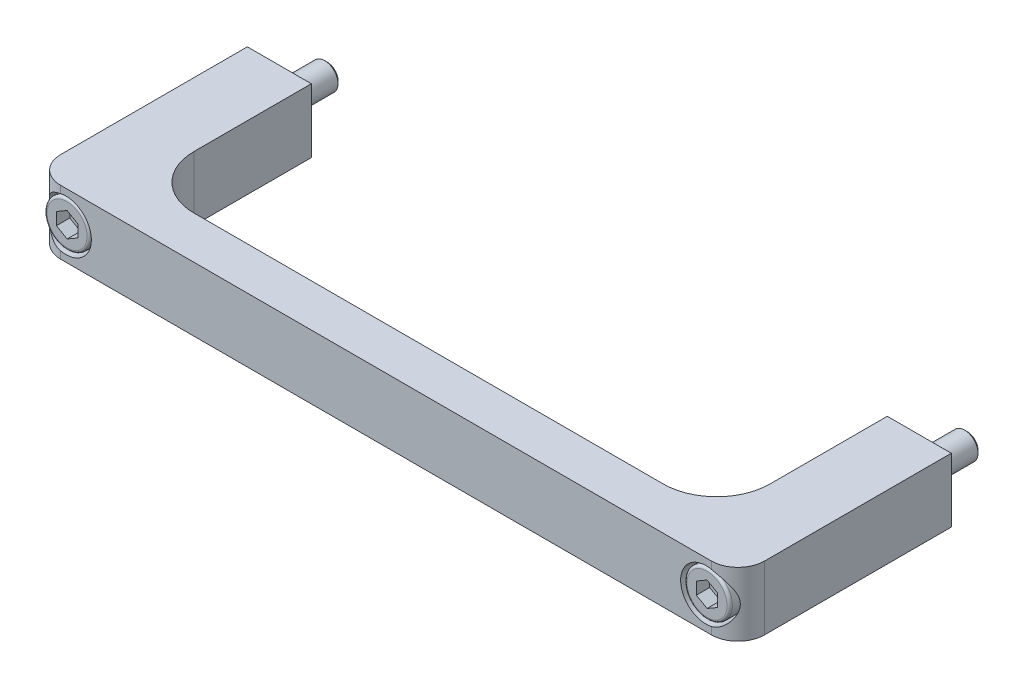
ISO-10303-21;
HEADER;
FILE_DESCRIPTION(('STEP AP214'),'2;1');
FILE_NAME('part.step','',(''),(''),'','','');
FILE_SCHEMA(('AUTOMOTIVE_DESIGN { 1 0 10303 214 1 1 1 1 }'));
ENDSEC;
DATA;
#1=APPLICATION_CONTEXT('core data for automotive mechanical design processes');
#2=APPLICATION_PROTOCOL_DEFINITION('international standard','automotive_design',2000,#1);
#3=PRODUCT_CONTEXT('',#1,'mechanical');
#4=PRODUCT('Part','Part','',(#3));
#5=PRODUCT_RELATED_PRODUCT_CATEGORY('part','',(#4));
#6=PRODUCT_DEFINITION_FORMATION('','',#4);
#7=PRODUCT_DEFINITION_CONTEXT('part definition',#1,'design');
#8=PRODUCT_DEFINITION('design','',#6,#7);
#9=PRODUCT_DEFINITION_SHAPE('','',#8);
#10=(LENGTH_UNIT() NAMED_UNIT(*) SI_UNIT(.MILLI.,.METRE.));
#11=(NAMED_UNIT(*) PLANE_ANGLE_UNIT() SI_UNIT($,.RADIAN.));
#12=(NAMED_UNIT(*) SI_UNIT($,.STERADIAN.) SOLID_ANGLE_UNIT());
#13=UNCERTAINTY_MEASURE_WITH_UNIT(LENGTH_MEASURE(1.E-05),#10,'distance_accuracy_value','');
#14=(GEOMETRIC_REPRESENTATION_CONTEXT(3) GLOBAL_UNCERTAINTY_ASSIGNED_CONTEXT((#13)) GLOBAL_UNIT_ASSIGNED_CONTEXT((#10,
#11,#12)) REPRESENTATION_CONTEXT('',''));
#15=CARTESIAN_POINT('',(0.,0.,0.));
#16=DIRECTION('',(0.,0.,1.));
#17=DIRECTION('',(1.,0.,0.));
#18=AXIS2_PLACEMENT_3D('',#15,#16,#17);
#19=CARTESIAN_POINT('',(120.,-1.38960957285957E-13,39.8));
#20=DIRECTION('',(0.,0.,-1.));
#21=DIRECTION('',(0.,1.,0.));
#22=AXIS2_PLACEMENT_3D('',#19,#20,#21);
#23=PLANE('',#22);
#24=CARTESIAN_POINT('',(120.,-1.38960957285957E-13,39.8));
#25=DIRECTION('',(0.,0.,-1.));
#26=DIRECTION('',(0.,1.,0.));
#27=AXIS2_PLACEMENT_3D('',#24,#25,#26);
#28=CIRCLE('',#27,3.75);
#29=CARTESIAN_POINT('',(120.,3.74999999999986,39.8));
#30=VERTEX_POINT('',#29);
#31=EDGE_CURVE('E268',#30,#30,#28,.T.);
#32=ORIENTED_EDGE('',*,*,#31,.F.);
#33=EDGE_LOOP('',(#32));
#34=FACE_BOUND('',#33,.T.);
#35=DIRECTION('',(0.,-1.,0.));
#36=VECTOR('',#35,1.);
#37=CARTESIAN_POINT('',(118.,-1.38960957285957E-13,39.8));
#38=LINE('',#37,#36);
#39=CARTESIAN_POINT('',(118.,1.15470053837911,39.8));
#40=VERTEX_POINT('',#39);
#41=CARTESIAN_POINT('',(118.,-1.15470053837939,39.8));
#42=VERTEX_POINT('',#41);
#43=EDGE_CURVE('E9',#40,#42,#38,.T.);
#44=ORIENTED_EDGE('',*,*,#43,.F.);
#45=DIRECTION('',(-0.866025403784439,-0.5,0.));
#46=VECTOR('',#45,1.);
#47=CARTESIAN_POINT('',(119.,1.73205080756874,39.8));
#48=LINE('',#47,#46);
#49=CARTESIAN_POINT('',(120.,2.30940107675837,39.8));
#50=VERTEX_POINT('',#49);
#51=EDGE_CURVE('E433',#50,#40,#48,.T.);
#52=ORIENTED_EDGE('',*,*,#51,.F.);
#53=DIRECTION('',(-0.866025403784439,0.5,0.));
#54=VECTOR('',#53,1.);
#55=CARTESIAN_POINT('',(121.,1.73205080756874,39.8));
#56=LINE('',#55,#54);
#57=CARTESIAN_POINT('',(122.,1.15470053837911,39.8));
#58=VERTEX_POINT('',#57);
#59=EDGE_CURVE('E435',#58,#50,#56,.T.);
#60=ORIENTED_EDGE('',*,*,#59,.F.);
#61=DIRECTION('',(0.,1.,0.));
#62=VECTOR('',#61,1.);
#63=CARTESIAN_POINT('',(122.,-1.38960957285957E-13,39.8));
#64=LINE('',#63,#62);
#65=CARTESIAN_POINT('',(122.,-1.15470053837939,39.8));
#66=VERTEX_POINT('',#65);
#67=EDGE_CURVE('E437',#66,#58,#64,.T.);
#68=ORIENTED_EDGE('',*,*,#67,.F.);
#69=DIRECTION('',(0.866025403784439,0.5,0.));
#70=VECTOR('',#69,1.);
#71=CARTESIAN_POINT('',(121.,-1.73205080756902,39.8));
#72=LINE('',#71,#70);
#73=CARTESIAN_POINT('',(120.,-2.30940107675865,39.8));
#74=VERTEX_POINT('',#73);
#75=EDGE_CURVE('E439',#74,#66,#72,.T.);
#76=ORIENTED_EDGE('',*,*,#75,.F.);
#77=DIRECTION('',(0.866025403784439,-0.5,0.));
#78=VECTOR('',#77,1.);
#79=CARTESIAN_POINT('',(119.,-1.73205080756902,39.8));
#80=LINE('',#79,#78);
#81=EDGE_CURVE('E23',#42,#74,#80,.T.);
#82=ORIENTED_EDGE('',*,*,#81,.F.);
#83=EDGE_LOOP('',(#44,#52,#60,#68,#76,#82));
#84=FACE_BOUND('',#83,.T.);
#85=ADVANCED_FACE('F14',(#34,#84),#23,.F.);
#86=CARTESIAN_POINT('',(0.,-1.38960957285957E-13,39.8));
#87=DIRECTION('',(0.,0.,-1.));
#88=DIRECTION('',(0.,1.,0.));
#89=AXIS2_PLACEMENT_3D('',#86,#87,#88);
#90=PLANE('',#89);
#91=CARTESIAN_POINT('',(0.,-1.38960957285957E-13,39.8));
#92=DIRECTION('',(0.,0.,-1.));
#93=DIRECTION('',(0.,1.,0.));
#94=AXIS2_PLACEMENT_3D('',#91,#92,#93);
#95=CIRCLE('',#94,3.75);
#96=CARTESIAN_POINT('',(0.,3.74999999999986,39.8));
#97=VERTEX_POINT('',#96);
#98=EDGE_CURVE('E277',#97,#97,#95,.T.);
#99=ORIENTED_EDGE('',*,*,#98,.F.);
#100=EDGE_LOOP('',(#99));
#101=FACE_BOUND('',#100,.T.);
#102=DIRECTION('',(0.,-1.,0.));
#103=VECTOR('',#102,1.);
#104=CARTESIAN_POINT('',(-2.,-1.38960957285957E-13,39.8));
#105=LINE('',#104,#103);
#106=CARTESIAN_POINT('',(-2.,1.15470053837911,39.8));
#107=VERTEX_POINT('',#106);
#108=CARTESIAN_POINT('',(-2.,-1.15470053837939,39.8));
#109=VERTEX_POINT('',#108);
#110=EDGE_CURVE('E431',#107,#109,#105,.T.);
#111=ORIENTED_EDGE('',*,*,#110,.F.);
#112=DIRECTION('',(-0.866025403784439,-0.5,0.));
#113=VECTOR('',#112,1.);
#114=CARTESIAN_POINT('',(-1.,1.73205080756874,39.8));
#115=LINE('',#114,#113);
#116=CARTESIAN_POINT('',(0.,2.30940107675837,39.8));
#117=VERTEX_POINT('',#116);
#118=EDGE_CURVE('E420',#117,#107,#115,.T.);
#119=ORIENTED_EDGE('',*,*,#118,.F.);
#120=DIRECTION('',(-0.866025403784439,0.5,0.));
#121=VECTOR('',#120,1.);
#122=CARTESIAN_POINT('',(1.,1.73205080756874,39.8));
#123=LINE('',#122,#121);
#124=CARTESIAN_POINT('',(2.,1.15470053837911,39.8));
#125=VERTEX_POINT('',#124);
#126=EDGE_CURVE('E422',#125,#117,#123,.T.);
#127=ORIENTED_EDGE('',*,*,#126,.F.);
#128=DIRECTION('',(0.,1.,0.));
#129=VECTOR('',#128,1.);
#130=CARTESIAN_POINT('',(2.,-1.38960957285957E-13,39.8));
#131=LINE('',#130,#129);
#132=CARTESIAN_POINT('',(2.,-1.15470053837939,39.8));
#133=VERTEX_POINT('',#132);
#134=EDGE_CURVE('E424',#133,#125,#131,.T.);
#135=ORIENTED_EDGE('',*,*,#134,.F.);
#136=DIRECTION('',(0.866025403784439,0.5,0.));
#137=VECTOR('',#136,1.);
#138=CARTESIAN_POINT('',(1.,-1.73205080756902,39.8));
#139=LINE('',#138,#137);
#140=CARTESIAN_POINT('',(0.,-2.30940107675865,39.8));
#141=VERTEX_POINT('',#140);
#142=EDGE_CURVE('E426',#141,#133,#139,.T.);
#143=ORIENTED_EDGE('',*,*,#142,.F.);
#144=DIRECTION('',(0.866025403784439,-0.5,0.));
#145=VECTOR('',#144,1.);
#146=CARTESIAN_POINT('',(-1.,-1.73205080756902,39.8));
#147=LINE('',#146,#145);
#148=EDGE_CURVE('E429',#109,#141,#147,.T.);
#149=ORIENTED_EDGE('',*,*,#148,.F.);
#150=EDGE_LOOP('',(#111,#119,#127,#135,#143,#149));
#151=FACE_BOUND('',#150,.T.);
#152=ADVANCED_FACE('F520',(#101,#151),#90,.F.);
#153=CARTESIAN_POINT('',(121.,-6.00000000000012,35.));
#154=DIRECTION('',(0.,1.,0.));
#155=DIRECTION('',(-1.,0.,0.));
#156=AXIS2_PLACEMENT_3D('',#153,#154,#155);
#157=CYLINDRICAL_SURFACE('',#156,5.);
#158=CARTESIAN_POINT('',(121.,-4.64354390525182,40.));
#159=CARTESIAN_POINT('',(121.113577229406,-4.61911352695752,40.000026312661));
#160=CARTESIAN_POINT('',(121.226198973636,-4.5904727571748,39.996131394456));
#161=CARTESIAN_POINT('',(121.448480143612,-4.5252330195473,39.9810830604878));
#162=CARTESIAN_POINT('',(121.558142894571,-4.48864344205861,39.9699381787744));
#163=CARTESIAN_POINT('',(121.772778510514,-4.40826406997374,39.9410985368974));
#164=CARTESIAN_POINT('',(121.877784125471,-4.36454038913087,39.9234622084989));
#165=CARTESIAN_POINT('',(122.083450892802,-4.2701927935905,39.8823298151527));
#166=CARTESIAN_POINT('',(122.184110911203,-4.2195670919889,39.8588322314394));
#167=CARTESIAN_POINT('',(122.477816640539,-4.05863601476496,39.7808868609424));
#168=CARTESIAN_POINT('',(122.663755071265,-3.93883272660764,39.7188155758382));
#169=CARTESIAN_POINT('',(123.014161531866,-3.67767986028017,39.5802666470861));
#170=CARTESIAN_POINT('',(123.178576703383,-3.53627901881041,39.5037546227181));
#171=CARTESIAN_POINT('',(123.50556315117,-3.21450833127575,39.3313669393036));
#172=CARTESIAN_POINT('',(123.664844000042,-3.03145406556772,39.2342729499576));
#173=CARTESIAN_POINT('',(123.953554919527,-2.64393120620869,39.0381869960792));
#174=CARTESIAN_POINT('',(124.082967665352,-2.43945028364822,38.9391939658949));
#175=CARTESIAN_POINT('',(124.300406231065,-2.02927596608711,38.7583847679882));
#176=CARTESIAN_POINT('',(124.391102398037,-1.82533494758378,38.6758243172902));
#177=CARTESIAN_POINT('',(124.544220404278,-1.40111936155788,38.528431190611));
#178=CARTESIAN_POINT('',(124.606705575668,-1.1808826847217,38.4635589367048));
#179=CARTESIAN_POINT('',(124.68939020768,-0.77750572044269,38.3750946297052));
#180=CARTESIAN_POINT('',(124.715905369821,-0.597016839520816,38.3455288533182));
#181=CARTESIAN_POINT('',(124.74785251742,-0.232010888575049,38.3097185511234));
#182=CARTESIAN_POINT('',(124.753317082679,-0.047500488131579,38.3034379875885));
#183=CARTESIAN_POINT('',(124.742772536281,0.320047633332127,38.3153716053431));
#184=CARTESIAN_POINT('',(124.726764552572,0.503085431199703,38.3335844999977));
#185=CARTESIAN_POINT('',(124.674507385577,0.862962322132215,38.3910845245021));
#186=CARTESIAN_POINT('',(124.638217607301,1.03978822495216,38.4304139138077));
#187=CARTESIAN_POINT('',(124.5280009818,1.4574449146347,38.5442545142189));
#188=CARTESIAN_POINT('',(124.444640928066,1.69363572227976,38.626612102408));
#189=CARTESIAN_POINT('',(124.295087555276,2.03224760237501,38.7612447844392));
#190=CARTESIAN_POINT('',(124.24105214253,2.1426583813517,38.8080496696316));
#191=CARTESIAN_POINT('',(124.12505065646,2.35826640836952,38.9038071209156));
#192=CARTESIAN_POINT('',(124.063085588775,2.46346431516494,38.9527594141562));
#193=CARTESIAN_POINT('',(123.860708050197,2.77873907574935,39.1043117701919));
#194=CARTESIAN_POINT('',(123.707477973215,2.98020199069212,39.2081022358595));
#195=CARTESIAN_POINT('',(123.368846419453,3.35822314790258,39.4076351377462));
#196=CARTESIAN_POINT('',(123.183479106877,3.53480748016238,39.5033859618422));
#197=CARTESIAN_POINT('',(122.809666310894,3.83632408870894,39.6648073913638));
#198=CARTESIAN_POINT('',(122.625331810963,3.96502834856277,39.7328152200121));
#199=CARTESIAN_POINT('',(122.333406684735,4.13890556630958,39.8199942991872));
#200=CARTESIAN_POINT('',(122.233611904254,4.19363274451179,39.8465668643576));
#201=CARTESIAN_POINT('',(122.029283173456,4.29622741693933,39.8940340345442));
#202=CARTESIAN_POINT('',(121.924750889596,4.34409729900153,39.9149306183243));
#203=CARTESIAN_POINT('',(121.687151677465,4.4425312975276,39.9543331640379));
#204=CARTESIAN_POINT('',(121.55301541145,4.49121867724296,39.9712061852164));
#205=CARTESIAN_POINT('',(121.348187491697,4.55522115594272,39.9883353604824));
#206=CARTESIAN_POINT('',(121.279206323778,4.57507245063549,39.9926820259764));
#207=CARTESIAN_POINT('',(121.140272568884,4.61166374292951,39.9985159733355));
#208=CARTESIAN_POINT('',(121.070319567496,4.62840236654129,40.0000019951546));
#209=CARTESIAN_POINT('',(121.,4.64354390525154,40.));
#210=B_SPLINE_CURVE_WITH_KNOTS('',3,(#158,#159,#160,#161,#162,#163,#164,#165,#166,#167,#168,
#169,#170,#171,#172,#173,#174,#175,#176,#177,#178,#179,#180,#181,#182,#183,#184,#185,#186,#187,
#188,#189,#190,#191,#192,#193,#194,#195,#196,#197,#198,#199,#200,#201,#202,#203,#204,#205,#206,
#207,#208,#209),.UNSPECIFIED.,.F.,.F.,(4,2,2,2,2,2,2,2,2,2,2,2,2,2,2,2,2,2,2,2,2,2,2,2,2,4),(0.,
0.348307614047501,0.696205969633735,1.04104644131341,1.38597636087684,2.07210353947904,
2.7598853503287,3.54118531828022,4.32293734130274,5.03460033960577,5.74465765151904,
6.29670085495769,6.84788932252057,7.3990488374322,7.95131549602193,8.73767249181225,
9.13202620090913,9.52632994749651,10.3438248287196,11.1604559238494,11.8620649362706,
12.2123213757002,12.5624555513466,12.992467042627,13.2080905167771,13.4238089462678),.UNSPECIFIED.);
#211=CARTESIAN_POINT('',(121.,-4.64354390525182,40.));
#212=VERTEX_POINT('',#211);
#213=CARTESIAN_POINT('',(121.,4.64354390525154,40.));
#214=VERTEX_POINT('',#213);
#215=EDGE_CURVE('E283',#212,#214,#210,.T.);
#216=ORIENTED_EDGE('',*,*,#215,.F.);
#217=DIRECTION('',(0.,1.,0.));
#218=VECTOR('',#217,1.);
#219=CARTESIAN_POINT('',(121.,-6.00000000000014,40.));
#220=LINE('',#219,#218);
#221=CARTESIAN_POINT('',(121.,-6.00000000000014,40.));
#222=VERTEX_POINT('',#221);
#223=EDGE_CURVE('E387',#222,#212,#220,.T.);
#224=ORIENTED_EDGE('',*,*,#223,.F.);
#225=CARTESIAN_POINT('',(121.,-6.00000000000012,35.));
#226=DIRECTION('',(0.,-1.,0.));
#227=DIRECTION('',(1.,0.,0.));
#228=AXIS2_PLACEMENT_3D('',#225,#226,#227);
#229=CIRCLE('',#228,5.);
#230=CARTESIAN_POINT('',(126.,-6.00000000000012,35.));
#231=VERTEX_POINT('',#230);
#232=EDGE_CURVE('E349',#231,#222,#229,.T.);
#233=ORIENTED_EDGE('',*,*,#232,.F.);
#234=DIRECTION('',(0.,1.,0.));
#235=VECTOR('',#234,1.);
#236=CARTESIAN_POINT('',(126.,-6.00000000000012,35.));
#237=LINE('',#236,#235);
#238=CARTESIAN_POINT('',(126.,5.99999999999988,35.));
#239=VERTEX_POINT('',#238);
#240=EDGE_CURVE('E390',#231,#239,#237,.T.);
#241=ORIENTED_EDGE('',*,*,#240,.T.);
#242=CARTESIAN_POINT('',(121.,5.99999999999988,35.));
#243=DIRECTION('',(0.,-1.,0.));
#244=DIRECTION('',(1.,0.,0.));
#245=AXIS2_PLACEMENT_3D('',#242,#243,#244);
#246=CIRCLE('',#245,5.);
#247=CARTESIAN_POINT('',(121.,5.99999999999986,40.));
#248=VERTEX_POINT('',#247);
#249=EDGE_CURVE('E378',#239,#248,#246,.T.);
#250=ORIENTED_EDGE('',*,*,#249,.T.);
#251=EDGE_CURVE('E386',#214,#248,#220,.T.);
#252=ORIENTED_EDGE('',*,*,#251,.F.);
#253=EDGE_LOOP('',(#216,#224,#233,#241,#250,#252));
#254=FACE_BOUND('',#253,.T.);
#255=ADVANCED_FACE('F293',(#254),#157,.T.);
#256=CARTESIAN_POINT('',(-1.,-6.00000000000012,35.));
#257=DIRECTION('',(0.,1.,0.));
#258=DIRECTION('',(-1.,0.,0.));
#259=AXIS2_PLACEMENT_3D('',#256,#257,#258);
#260=CYLINDRICAL_SURFACE('',#259,5.);
#261=CARTESIAN_POINT('',(-0.999999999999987,4.64354390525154,40.));
#262=CARTESIAN_POINT('',(-1.11357722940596,4.61911352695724,40.000026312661));
#263=CARTESIAN_POINT('',(-1.22619897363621,4.59047275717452,39.9961313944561));
#264=CARTESIAN_POINT('',(-1.44848014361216,4.52523301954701,39.9810830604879));
#265=CARTESIAN_POINT('',(-1.55814289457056,4.48864344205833,39.9699381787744));
#266=CARTESIAN_POINT('',(-1.7727785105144,4.40826406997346,39.9410985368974));
#267=CARTESIAN_POINT('',(-1.87778412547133,4.3645403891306,39.9234622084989));
#268=CARTESIAN_POINT('',(-2.08345089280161,4.27019279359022,39.8823298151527));
#269=CARTESIAN_POINT('',(-2.18411091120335,4.21956709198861,39.8588322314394));
#270=CARTESIAN_POINT('',(-2.47781664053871,4.05863601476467,39.7808868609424));
#271=CARTESIAN_POINT('',(-2.66375507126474,3.93883272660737,39.7188155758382));
#272=CARTESIAN_POINT('',(-3.0141615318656,3.67767986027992,39.5802666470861));
#273=CARTESIAN_POINT('',(-3.17857670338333,3.53627901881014,39.5037546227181));
#274=CARTESIAN_POINT('',(-3.50556315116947,3.21450833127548,39.3313669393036));
#275=CARTESIAN_POINT('',(-3.66484400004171,3.03145406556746,39.2342729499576));
#276=CARTESIAN_POINT('',(-3.95355491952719,2.64393120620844,39.0381869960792));
#277=CARTESIAN_POINT('',(-4.0829676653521,2.43945028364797,38.9391939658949));
#278=CARTESIAN_POINT('',(-4.30040623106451,2.02927596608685,38.7583847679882));
#279=CARTESIAN_POINT('',(-4.39110239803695,1.82533494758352,38.6758243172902));
#280=CARTESIAN_POINT('',(-4.54422040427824,1.40111936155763,38.528431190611));
#281=CARTESIAN_POINT('',(-4.606705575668,1.18088268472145,38.4635589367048));
#282=CARTESIAN_POINT('',(-4.68939020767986,0.777505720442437,38.3750946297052));
#283=CARTESIAN_POINT('',(-4.71590536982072,0.597016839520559,38.3455288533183));
#284=CARTESIAN_POINT('',(-4.74785251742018,0.23201088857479,38.3097185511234));
#285=CARTESIAN_POINT('',(-4.75331708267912,0.0475004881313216,38.3034379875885));
#286=CARTESIAN_POINT('',(-4.74277253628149,-0.320047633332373,38.3153716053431));
#287=CARTESIAN_POINT('',(-4.72676455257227,-0.503085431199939,38.3335844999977));
#288=CARTESIAN_POINT('',(-4.67450738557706,-0.862962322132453,38.3910845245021));
#289=CARTESIAN_POINT('',(-4.63821760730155,-1.03978822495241,38.4304139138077));
#290=CARTESIAN_POINT('',(-4.52800098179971,-1.45744491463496,38.5442545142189));
#291=CARTESIAN_POINT('',(-4.44464092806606,-1.69363572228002,38.626612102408));
#292=CARTESIAN_POINT('',(-4.29508755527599,-2.03224760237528,38.7612447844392));
#293=CARTESIAN_POINT('',(-4.24105214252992,-2.14265838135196,38.8080496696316));
#294=CARTESIAN_POINT('',(-4.1250506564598,-2.35826640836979,38.9038071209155));
#295=CARTESIAN_POINT('',(-4.06308558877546,-2.4634643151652,38.9527594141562));
#296=CARTESIAN_POINT('',(-3.86070805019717,-2.7787390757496,39.1043117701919));
#297=CARTESIAN_POINT('',(-3.70747797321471,-2.98020199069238,39.2081022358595));
#298=CARTESIAN_POINT('',(-3.36884641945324,-3.35822314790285,39.4076351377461));
#299=CARTESIAN_POINT('',(-3.18347910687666,-3.53480748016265,39.5033859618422));
#300=CARTESIAN_POINT('',(-2.80966631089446,-3.83632408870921,39.6648073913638));
#301=CARTESIAN_POINT('',(-2.62533181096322,-3.96502834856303,39.7328152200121));
#302=CARTESIAN_POINT('',(-2.33340668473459,-4.13890556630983,39.8199942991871));
#303=CARTESIAN_POINT('',(-2.23361190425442,-4.19363274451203,39.8465668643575));
#304=CARTESIAN_POINT('',(-2.0292831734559,-4.29622741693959,39.8940340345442));
#305=CARTESIAN_POINT('',(-1.92475088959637,-4.34409729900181,39.9149306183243));
#306=CARTESIAN_POINT('',(-1.68715167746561,-4.44253129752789,39.9543331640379));
#307=CARTESIAN_POINT('',(-1.55301541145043,-4.49121867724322,39.9712061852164));
#308=CARTESIAN_POINT('',(-1.34818749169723,-4.55522115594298,39.9883353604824));
#309=CARTESIAN_POINT('',(-1.27920632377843,-4.57507245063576,39.9926820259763));
#310=CARTESIAN_POINT('',(-1.14027256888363,-4.61166374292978,39.9985159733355));
#311=CARTESIAN_POINT('',(-1.07031956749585,-4.62840236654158,40.0000019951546));
#312=CARTESIAN_POINT('',(-0.999999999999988,-4.64354390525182,40.));
#313=B_SPLINE_CURVE_WITH_KNOTS('',3,(#261,#262,#263,#264,#265,#266,#267,#268,#269,#270,#271,
#272,#273,#274,#275,#276,#277,#278,#279,#280,#281,#282,#283,#284,#285,#286,#287,#288,#289,#290,
#291,#292,#293,#294,#295,#296,#297,#298,#299,#300,#301,#302,#303,#304,#305,#306,#307,#308,#309,
#310,#311,#312),.UNSPECIFIED.,.F.,.F.,(4,2,2,2,2,2,2,2,2,2,2,2,2,2,2,2,2,2,2,2,2,2,2,2,2,4),(0.,
0.348307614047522,0.696205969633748,1.04104644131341,1.38597636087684,2.07210353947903,
2.75988535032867,3.54118531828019,4.32293734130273,5.03460033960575,5.74465765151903,
6.29670085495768,6.84788932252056,7.39904883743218,7.95131549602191,8.73767249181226,
9.13202620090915,9.52632994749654,10.3438248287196,11.1604559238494,11.8620649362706,
12.2123213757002,12.5624555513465,12.992467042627,13.2080905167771,13.4238089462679),.UNSPECIFIED.);
#314=CARTESIAN_POINT('',(-0.999999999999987,4.64354390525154,40.));
#315=VERTEX_POINT('',#314);
#316=CARTESIAN_POINT('',(-0.999999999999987,-4.64354390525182,40.));
#317=VERTEX_POINT('',#316);
#318=EDGE_CURVE('E317',#315,#317,#313,.T.);
#319=ORIENTED_EDGE('',*,*,#318,.F.);
#320=DIRECTION('',(0.,1.,0.));
#321=VECTOR('',#320,1.);
#322=CARTESIAN_POINT('',(-0.999999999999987,-6.00000000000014,40.));
#323=LINE('',#322,#321);
#324=CARTESIAN_POINT('',(-0.999999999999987,5.99999999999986,40.));
#325=VERTEX_POINT('',#324);
#326=EDGE_CURVE('E353',#315,#325,#323,.T.);
#327=ORIENTED_EDGE('',*,*,#326,.T.);
#328=CARTESIAN_POINT('',(-1.,5.99999999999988,35.));
#329=DIRECTION('',(0.,-1.,0.));
#330=DIRECTION('',(1.,0.,0.));
#331=AXIS2_PLACEMENT_3D('',#328,#329,#330);
#332=CIRCLE('',#331,5.);
#333=CARTESIAN_POINT('',(-6.,5.99999999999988,35.));
#334=VERTEX_POINT('',#333);
#335=EDGE_CURVE('E324',#325,#334,#332,.T.);
#336=ORIENTED_EDGE('',*,*,#335,.T.);
#337=DIRECTION('',(0.,1.,0.));
#338=VECTOR('',#337,1.);
#339=CARTESIAN_POINT('',(-6.,-6.00000000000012,35.));
#340=LINE('',#339,#338);
#341=CARTESIAN_POINT('',(-6.,-6.00000000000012,35.));
#342=VERTEX_POINT('',#341);
#343=EDGE_CURVE('E413',#342,#334,#340,.T.);
#344=ORIENTED_EDGE('',*,*,#343,.F.);
#345=CARTESIAN_POINT('',(-1.,-6.00000000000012,35.));
#346=DIRECTION('',(0.,-1.,0.));
#347=DIRECTION('',(1.,0.,0.));
#348=AXIS2_PLACEMENT_3D('',#345,#346,#347);
#349=CIRCLE('',#348,5.);
#350=CARTESIAN_POINT('',(-0.999999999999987,-6.00000000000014,40.));
#351=VERTEX_POINT('',#350);
#352=EDGE_CURVE('E325',#351,#342,#349,.T.);
#353=ORIENTED_EDGE('',*,*,#352,.F.);
#354=EDGE_CURVE('E383',#351,#317,#323,.T.);
#355=ORIENTED_EDGE('',*,*,#354,.T.);
#356=EDGE_LOOP('',(#319,#327,#336,#344,#353,#355));
#357=FACE_BOUND('',#356,.T.);
#358=ADVANCED_FACE('F16',(#357),#260,.T.);
#359=CARTESIAN_POINT('',(-6.,-6.00000000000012,35.));
#360=DIRECTION('',(1.,0.,0.));
#361=DIRECTION('',(0.,1.,0.));
#362=AXIS2_PLACEMENT_3D('',#359,#360,#361);
#363=PLANE('',#362);
#364=DIRECTION('',(0.,0.,-1.));
#365=VECTOR('',#364,1.);
#366=CARTESIAN_POINT('',(-6.,5.99999999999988,35.));
#367=LINE('',#366,#365);
#368=CARTESIAN_POINT('',(-6.,6.,0.));
#369=VERTEX_POINT('',#368);
#370=EDGE_CURVE('E356',#334,#369,#367,.T.);
#371=ORIENTED_EDGE('',*,*,#370,.T.);
#372=DIRECTION('',(0.,1.,0.));
#373=VECTOR('',#372,1.);
#374=CARTESIAN_POINT('',(-6.,-6.,0.));
#375=LINE('',#374,#373);
#376=CARTESIAN_POINT('',(-6.,-6.,0.));
#377=VERTEX_POINT('',#376);
#378=EDGE_CURVE('E410',#377,#369,#375,.T.);
#379=ORIENTED_EDGE('',*,*,#378,.F.);
#380=DIRECTION('',(0.,0.,-1.));
#381=VECTOR('',#380,1.);
#382=CARTESIAN_POINT('',(-6.,-6.00000000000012,35.));
#383=LINE('',#382,#381);
#384=EDGE_CURVE('E328',#342,#377,#383,.T.);
#385=ORIENTED_EDGE('',*,*,#384,.F.);
#386=ORIENTED_EDGE('',*,*,#343,.T.);
#387=EDGE_LOOP('',(#371,#379,#385,#386));
#388=FACE_BOUND('',#387,.T.);
#389=ADVANCED_FACE('F565',(#388),#363,.F.);
#390=CARTESIAN_POINT('',(-6.,-6.,0.));
#391=DIRECTION('',(0.,0.,1.));
#392=DIRECTION('',(0.,-1.,0.));
#393=AXIS2_PLACEMENT_3D('',#390,#391,#392);
#394=PLANE('',#393);
#395=DIRECTION('',(1.,0.,0.));
#396=VECTOR('',#395,1.);
#397=CARTESIAN_POINT('',(-6.,6.,0.));
#398=LINE('',#397,#396);
#399=CARTESIAN_POINT('',(6.,6.,0.));
#400=VERTEX_POINT('',#399);
#401=EDGE_CURVE('E358',#369,#400,#398,.T.);
#402=ORIENTED_EDGE('',*,*,#401,.T.);
#403=DIRECTION('',(0.,1.,0.));
#404=VECTOR('',#403,1.);
#405=CARTESIAN_POINT('',(6.,-6.,0.));
#406=LINE('',#405,#404);
#407=CARTESIAN_POINT('',(6.,-6.,0.));
#408=VERTEX_POINT('',#407);
#409=EDGE_CURVE('E407',#408,#400,#406,.T.);
#410=ORIENTED_EDGE('',*,*,#409,.F.);
#411=DIRECTION('',(1.,0.,0.));
#412=VECTOR('',#411,1.);
#413=CARTESIAN_POINT('',(-6.,-6.,0.));
#414=LINE('',#413,#412);
#415=EDGE_CURVE('E331',#377,#408,#414,.T.);
#416=ORIENTED_EDGE('',*,*,#415,.F.);
#417=ORIENTED_EDGE('',*,*,#378,.T.);
#418=EDGE_LOOP('',(#402,#410,#416,#417));
#419=FACE_BOUND('',#418,.T.);
#420=CARTESIAN_POINT('',(0.,0.,0.));
#421=DIRECTION('',(0.,0.,-1.));
#422=DIRECTION('',(0.,1.,0.));
#423=AXIS2_PLACEMENT_3D('',#420,#421,#422);
#424=CIRCLE('',#423,2.5);
#425=CARTESIAN_POINT('',(0.,2.5,0.));
#426=VERTEX_POINT('',#425);
#427=EDGE_CURVE('E912',#426,#426,#424,.T.);
#428=ORIENTED_EDGE('',*,*,#427,.F.);
#429=EDGE_LOOP('',(#428));
#430=FACE_BOUND('',#429,.T.);
#431=ADVANCED_FACE('F600',(#419,#430),#394,.F.);
#432=CARTESIAN_POINT('',(6.,-6.,0.));
#433=DIRECTION('',(-1.,0.,0.));
#434=DIRECTION('',(0.,-1.,0.));
#435=AXIS2_PLACEMENT_3D('',#432,#433,#434);
#436=PLANE('',#435);
#437=DIRECTION('',(0.,0.,1.));
#438=VECTOR('',#437,1.);
#439=CARTESIAN_POINT('',(6.,6.,0.));
#440=LINE('',#439,#438);
#441=CARTESIAN_POINT('',(6.,5.99999999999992,22.));
#442=VERTEX_POINT('',#441);
#443=EDGE_CURVE('E360',#400,#442,#440,.T.);
#444=ORIENTED_EDGE('',*,*,#443,.T.);
#445=DIRECTION('',(0.,1.,0.));
#446=VECTOR('',#445,1.);
#447=CARTESIAN_POINT('',(6.,-6.00000000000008,22.));
#448=LINE('',#447,#446);
#449=CARTESIAN_POINT('',(6.,-6.00000000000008,22.));
#450=VERTEX_POINT('',#449);
#451=EDGE_CURVE('E405',#450,#442,#448,.T.);
#452=ORIENTED_EDGE('',*,*,#451,.F.);
#453=DIRECTION('',(0.,0.,1.));
#454=VECTOR('',#453,1.);
#455=CARTESIAN_POINT('',(6.,-6.,0.));
#456=LINE('',#455,#454);
#457=EDGE_CURVE('E333',#408,#450,#456,.T.);
#458=ORIENTED_EDGE('',*,*,#457,.F.);
#459=ORIENTED_EDGE('',*,*,#409,.T.);
#460=EDGE_LOOP('',(#444,#452,#458,#459));
#461=FACE_BOUND('',#460,.T.);
#462=ADVANCED_FACE('F605',(#461),#436,.F.);
#463=CARTESIAN_POINT('',(16.,-6.00000000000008,22.));
#464=DIRECTION('',(0.,1.,0.));
#465=DIRECTION('',(-1.,0.,0.));
#466=AXIS2_PLACEMENT_3D('',#463,#464,#465);
#467=CYLINDRICAL_SURFACE('',#466,10.);
#468=CARTESIAN_POINT('',(16.,5.99999999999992,22.));
#469=DIRECTION('',(0.,-1.,0.));
#470=DIRECTION('',(1.,0.,0.));
#471=AXIS2_PLACEMENT_3D('',#468,#469,#470);
#472=CIRCLE('',#471,10.);
#473=CARTESIAN_POINT('',(16.,5.99999999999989,32.));
#474=VERTEX_POINT('',#473);
#475=EDGE_CURVE('E363',#474,#442,#472,.T.);
#476=ORIENTED_EDGE('',*,*,#475,.F.);
#477=DIRECTION('',(0.,1.,0.));
#478=VECTOR('',#477,1.);
#479=CARTESIAN_POINT('',(16.,-6.00000000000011,32.));
#480=LINE('',#479,#478);
#481=CARTESIAN_POINT('',(16.,-6.00000000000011,32.));
#482=VERTEX_POINT('',#481);
#483=EDGE_CURVE('E403',#482,#474,#480,.T.);
#484=ORIENTED_EDGE('',*,*,#483,.F.);
#485=CARTESIAN_POINT('',(16.,-6.00000000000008,22.));
#486=DIRECTION('',(0.,-1.,0.));
#487=DIRECTION('',(1.,0.,0.));
#488=AXIS2_PLACEMENT_3D('',#485,#486,#487);
#489=CIRCLE('',#488,10.);
#490=EDGE_CURVE('E335',#482,#450,#489,.T.);
#491=ORIENTED_EDGE('',*,*,#490,.T.);
#492=ORIENTED_EDGE('',*,*,#451,.T.);
#493=EDGE_LOOP('',(#476,#484,#491,#492));
#494=FACE_BOUND('',#493,.T.);
#495=ADVANCED_FACE('F608',(#494),#467,.F.);
#496=CARTESIAN_POINT('',(16.,-6.00000000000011,32.));
#497=DIRECTION('',(0.,0.,1.));
#498=DIRECTION('',(0.,-1.,0.));
#499=AXIS2_PLACEMENT_3D('',#496,#497,#498);
#500=PLANE('',#499);
#501=DIRECTION('',(1.,0.,0.));
#502=VECTOR('',#501,1.);
#503=CARTESIAN_POINT('',(16.,5.99999999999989,32.));
#504=LINE('',#503,#502);
#505=CARTESIAN_POINT('',(104.,5.99999999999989,32.));
#506=VERTEX_POINT('',#505);
#507=EDGE_CURVE('E366',#474,#506,#504,.T.);
#508=ORIENTED_EDGE('',*,*,#507,.T.);
#509=DIRECTION('',(0.,1.,0.));
#510=VECTOR('',#509,1.);
#511=CARTESIAN_POINT('',(104.,-6.00000000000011,32.));
#512=LINE('',#511,#510);
#513=CARTESIAN_POINT('',(104.,-6.00000000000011,32.));
#514=VERTEX_POINT('',#513);
#515=EDGE_CURVE('E401',#514,#506,#512,.T.);
#516=ORIENTED_EDGE('',*,*,#515,.F.);
#517=DIRECTION('',(1.,0.,0.));
#518=VECTOR('',#517,1.);
#519=CARTESIAN_POINT('',(16.,-6.00000000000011,32.));
#520=LINE('',#519,#518);
#521=EDGE_CURVE('E338',#482,#514,#520,.T.);
#522=ORIENTED_EDGE('',*,*,#521,.F.);
#523=ORIENTED_EDGE('',*,*,#483,.T.);
#524=EDGE_LOOP('',(#508,#516,#522,#523));
#525=FACE_BOUND('',#524,.T.);
#526=ADVANCED_FACE('F613',(#525),#500,.F.);
#527=CARTESIAN_POINT('',(104.,-6.00000000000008,22.));
#528=DIRECTION('',(0.,1.,0.));
#529=DIRECTION('',(-1.,0.,0.));
#530=AXIS2_PLACEMENT_3D('',#527,#528,#529);
#531=CYLINDRICAL_SURFACE('',#530,10.);
#532=CARTESIAN_POINT('',(104.,5.99999999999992,22.));
#533=DIRECTION('',(0.,-1.,0.));
#534=DIRECTION('',(1.,0.,0.));
#535=AXIS2_PLACEMENT_3D('',#532,#533,#534);
#536=CIRCLE('',#535,10.);
#537=CARTESIAN_POINT('',(114.,5.99999999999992,22.));
#538=VERTEX_POINT('',#537);
#539=EDGE_CURVE('E369',#538,#506,#536,.T.);
#540=ORIENTED_EDGE('',*,*,#539,.F.);
#541=DIRECTION('',(0.,1.,0.));
#542=VECTOR('',#541,1.);
#543=CARTESIAN_POINT('',(114.,-6.00000000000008,22.));
#544=LINE('',#543,#542);
#545=CARTESIAN_POINT('',(114.,-6.00000000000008,22.));
#546=VERTEX_POINT('',#545);
#547=EDGE_CURVE('E399',#546,#538,#544,.T.);
#548=ORIENTED_EDGE('',*,*,#547,.F.);
#549=CARTESIAN_POINT('',(104.,-6.00000000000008,22.));
#550=DIRECTION('',(0.,-1.,0.));
#551=DIRECTION('',(1.,0.,0.));
#552=AXIS2_PLACEMENT_3D('',#549,#550,#551);
#553=CIRCLE('',#552,10.);
#554=EDGE_CURVE('E340',#546,#514,#553,.T.);
#555=ORIENTED_EDGE('',*,*,#554,.T.);
#556=ORIENTED_EDGE('',*,*,#515,.T.);
#557=EDGE_LOOP('',(#540,#548,#555,#556));
#558=FACE_BOUND('',#557,.T.);
#559=ADVANCED_FACE('F617',(#558),#531,.F.);
#560=CARTESIAN_POINT('',(114.,-6.00000000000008,22.));
#561=DIRECTION('',(1.,0.,0.));
#562=DIRECTION('',(0.,1.,0.));
#563=AXIS2_PLACEMENT_3D('',#560,#561,#562);
#564=PLANE('',#563);
#565=DIRECTION('',(0.,0.,-1.));
#566=VECTOR('',#565,1.);
#567=CARTESIAN_POINT('',(114.,5.99999999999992,22.));
#568=LINE('',#567,#566);
#569=CARTESIAN_POINT('',(114.,6.,0.));
#570=VERTEX_POINT('',#569);
#571=EDGE_CURVE('E372',#538,#570,#568,.T.);
#572=ORIENTED_EDGE('',*,*,#571,.T.);
#573=DIRECTION('',(0.,1.,0.));
#574=VECTOR('',#573,1.);
#575=CARTESIAN_POINT('',(114.,-6.,0.));
#576=LINE('',#575,#574);
#577=CARTESIAN_POINT('',(114.,-6.,0.));
#578=VERTEX_POINT('',#577);
#579=EDGE_CURVE('E396',#578,#570,#576,.T.);
#580=ORIENTED_EDGE('',*,*,#579,.F.);
#581=DIRECTION('',(0.,0.,-1.));
#582=VECTOR('',#581,1.);
#583=CARTESIAN_POINT('',(114.,-6.00000000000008,22.));
#584=LINE('',#583,#582);
#585=EDGE_CURVE('E343',#546,#578,#584,.T.);
#586=ORIENTED_EDGE('',*,*,#585,.F.);
#587=ORIENTED_EDGE('',*,*,#547,.T.);
#588=EDGE_LOOP('',(#572,#580,#586,#587));
#589=FACE_BOUND('',#588,.T.);
#590=ADVANCED_FACE('F622',(#589),#564,.F.);
#591=CARTESIAN_POINT('',(114.,-6.,0.));
#592=DIRECTION('',(0.,0.,1.));
#593=DIRECTION('',(0.,-1.,0.));
#594=AXIS2_PLACEMENT_3D('',#591,#592,#593);
#595=PLANE('',#594);
#596=DIRECTION('',(1.,0.,0.));
#597=VECTOR('',#596,1.);
#598=CARTESIAN_POINT('',(114.,6.,0.));
#599=LINE('',#598,#597);
#600=CARTESIAN_POINT('',(126.,6.,0.));
#601=VERTEX_POINT('',#600);
#602=EDGE_CURVE('E374',#570,#601,#599,.T.);
#603=ORIENTED_EDGE('',*,*,#602,.T.);
#604=DIRECTION('',(0.,1.,0.));
#605=VECTOR('',#604,1.);
#606=CARTESIAN_POINT('',(126.,-6.,0.));
#607=LINE('',#606,#605);
#608=CARTESIAN_POINT('',(126.,-6.,0.));
#609=VERTEX_POINT('',#608);
#610=EDGE_CURVE('E393',#609,#601,#607,.T.);
#611=ORIENTED_EDGE('',*,*,#610,.F.);
#612=DIRECTION('',(1.,0.,0.));
#613=VECTOR('',#612,1.);
#614=CARTESIAN_POINT('',(114.,-6.,0.));
#615=LINE('',#614,#613);
#616=EDGE_CURVE('E345',#578,#609,#615,.T.);
#617=ORIENTED_EDGE('',*,*,#616,.F.);
#618=ORIENTED_EDGE('',*,*,#579,.T.);
#619=EDGE_LOOP('',(#603,#611,#617,#618));
#620=FACE_BOUND('',#619,.T.);
#621=CARTESIAN_POINT('',(120.,0.,0.));
#622=DIRECTION('',(0.,0.,-1.));
#623=DIRECTION('',(0.,1.,0.));
#624=AXIS2_PLACEMENT_3D('',#621,#622,#623);
#625=CIRCLE('',#624,2.5);
#626=CARTESIAN_POINT('',(120.,2.5,0.));
#627=VERTEX_POINT('',#626);
#628=EDGE_CURVE('E916',#627,#627,#625,.T.);
#629=ORIENTED_EDGE('',*,*,#628,.F.);
#630=EDGE_LOOP('',(#629));
#631=FACE_BOUND('',#630,.T.);
#632=ADVANCED_FACE('F626',(#620,#631),#595,.F.);
#633=CARTESIAN_POINT('',(126.,-6.,0.));
#634=DIRECTION('',(-1.,0.,0.));
#635=DIRECTION('',(0.,-1.,0.));
#636=AXIS2_PLACEMENT_3D('',#633,#634,#635);
#637=PLANE('',#636);
#638=DIRECTION('',(0.,0.,1.));
#639=VECTOR('',#638,1.);
#640=CARTESIAN_POINT('',(126.,6.,0.));
#641=LINE('',#640,#639);
#642=EDGE_CURVE('E376',#601,#239,#641,.T.);
#643=ORIENTED_EDGE('',*,*,#642,.T.);
#644=ORIENTED_EDGE('',*,*,#240,.F.);
#645=DIRECTION('',(0.,0.,1.));
#646=VECTOR('',#645,1.);
#647=CARTESIAN_POINT('',(126.,-6.,0.));
#648=LINE('',#647,#646);
#649=EDGE_CURVE('E347',#609,#231,#648,.T.);
#650=ORIENTED_EDGE('',*,*,#649,.F.);
#651=ORIENTED_EDGE('',*,*,#610,.T.);
#652=EDGE_LOOP('',(#643,#644,#650,#651));
#653=FACE_BOUND('',#652,.T.);
#654=ADVANCED_FACE('F628',(#653),#637,.F.);
#655=CARTESIAN_POINT('',(121.,-6.00000000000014,40.));
#656=DIRECTION('',(0.,0.,-1.));
#657=DIRECTION('',(0.,1.,0.));
#658=AXIS2_PLACEMENT_3D('',#655,#656,#657);
#659=PLANE('',#658);
#660=CARTESIAN_POINT('',(120.,-1.39659253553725E-13,40.));
#661=DIRECTION('',(0.,0.,-1.));
#662=DIRECTION('',(0.,1.,0.));
#663=AXIS2_PLACEMENT_3D('',#660,#661,#662);
#664=CIRCLE('',#663,4.75);
#665=EDGE_CURVE('E418',#214,#212,#664,.F.);
#666=ORIENTED_EDGE('',*,*,#665,.F.);
#667=ORIENTED_EDGE('',*,*,#251,.T.);
#668=DIRECTION('',(-1.,0.,0.));
#669=VECTOR('',#668,1.);
#670=CARTESIAN_POINT('',(121.,5.99999999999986,40.));
#671=LINE('',#670,#669);
#672=EDGE_CURVE('E329',#248,#325,#671,.T.);
#673=ORIENTED_EDGE('',*,*,#672,.T.);
#674=ORIENTED_EDGE('',*,*,#326,.F.);
#675=CARTESIAN_POINT('',(0.,-1.39659253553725E-13,40.));
#676=DIRECTION('',(0.,0.,-1.));
#677=DIRECTION('',(0.,1.,0.));
#678=AXIS2_PLACEMENT_3D('',#675,#676,#677);
#679=CIRCLE('',#678,4.75);
#680=EDGE_CURVE('E416',#317,#315,#679,.F.);
#681=ORIENTED_EDGE('',*,*,#680,.F.);
#682=ORIENTED_EDGE('',*,*,#354,.F.);
#683=DIRECTION('',(-1.,0.,0.));
#684=VECTOR('',#683,1.);
#685=CARTESIAN_POINT('',(121.,-6.00000000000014,40.));
#686=LINE('',#685,#684);
#687=EDGE_CURVE('E351',#222,#351,#686,.T.);
#688=ORIENTED_EDGE('',*,*,#687,.F.);
#689=ORIENTED_EDGE('',*,*,#223,.T.);
#690=EDGE_LOOP('',(#666,#667,#673,#674,#681,#682,#688,#689));
#691=FACE_BOUND('',#690,.T.);
#692=ADVANCED_FACE('F575',(#691),#659,.F.);
#693=CARTESIAN_POINT('',(-1.,-6.00000000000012,35.));
#694=DIRECTION('',(0.,-1.,0.));
#695=DIRECTION('',(1.,0.,0.));
#696=AXIS2_PLACEMENT_3D('',#693,#694,#695);
#697=PLANE('',#696);
#698=ORIENTED_EDGE('',*,*,#352,.T.);
#699=ORIENTED_EDGE('',*,*,#384,.T.);
#700=ORIENTED_EDGE('',*,*,#415,.T.);
#701=ORIENTED_EDGE('',*,*,#457,.T.);
#702=ORIENTED_EDGE('',*,*,#490,.F.);
#703=ORIENTED_EDGE('',*,*,#521,.T.);
#704=ORIENTED_EDGE('',*,*,#554,.F.);
#705=ORIENTED_EDGE('',*,*,#585,.T.);
#706=ORIENTED_EDGE('',*,*,#616,.T.);
#707=ORIENTED_EDGE('',*,*,#649,.T.);
#708=ORIENTED_EDGE('',*,*,#232,.T.);
#709=ORIENTED_EDGE('',*,*,#687,.T.);
#710=EDGE_LOOP('',(#698,#699,#700,#701,#702,#703,#704,#705,#706,#707,#708,#709));
#711=FACE_BOUND('',#710,.T.);
#712=ADVANCED_FACE('F315',(#711),#697,.T.);
#713=CARTESIAN_POINT('',(-1.,5.99999999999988,35.));
#714=DIRECTION('',(0.,-1.,0.));
#715=DIRECTION('',(1.,0.,0.));
#716=AXIS2_PLACEMENT_3D('',#713,#714,#715);
#717=PLANE('',#716);
#718=ORIENTED_EDGE('',*,*,#335,.F.);
#719=ORIENTED_EDGE('',*,*,#672,.F.);
#720=ORIENTED_EDGE('',*,*,#249,.F.);
#721=ORIENTED_EDGE('',*,*,#642,.F.);
#722=ORIENTED_EDGE('',*,*,#602,.F.);
#723=ORIENTED_EDGE('',*,*,#571,.F.);
#724=ORIENTED_EDGE('',*,*,#539,.T.);
#725=ORIENTED_EDGE('',*,*,#507,.F.);
#726=ORIENTED_EDGE('',*,*,#475,.T.);
#727=ORIENTED_EDGE('',*,*,#443,.F.);
#728=ORIENTED_EDGE('',*,*,#401,.F.);
#729=ORIENTED_EDGE('',*,*,#370,.F.);
#730=EDGE_LOOP('',(#718,#719,#720,#721,#722,#723,#724,#725,#726,#727,#728,#729));
#731=FACE_BOUND('',#730,.T.);
#732=ADVANCED_FACE('F313',(#731),#717,.F.);
#733=CARTESIAN_POINT('',(0.,0.,0.));
#734=DIRECTION('',(0.,0.,-1.));
#735=DIRECTION('',(0.,1.,0.));
#736=AXIS2_PLACEMENT_3D('',#733,#734,#735);
#737=CYLINDRICAL_SURFACE('',#736,4.75);
#738=CARTESIAN_POINT('',(0.,-1.21503550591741E-13,34.8));
#739=DIRECTION('',(0.,0.,-1.));
#740=DIRECTION('',(0.,1.,0.));
#741=AXIS2_PLACEMENT_3D('',#738,#739,#740);
#742=CIRCLE('',#741,4.75);
#743=CARTESIAN_POINT('',(0.,4.74999999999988,34.8));
#744=VERTEX_POINT('',#743);
#745=EDGE_CURVE('E291',#744,#744,#742,.T.);
#746=ORIENTED_EDGE('',*,*,#745,.T.);
#747=EDGE_LOOP('',(#746));
#748=FACE_BOUND('',#747,.T.);
#749=ORIENTED_EDGE('',*,*,#318,.T.);
#750=ORIENTED_EDGE('',*,*,#680,.T.);
#751=EDGE_LOOP('',(#749,#750));
#752=FACE_BOUND('',#751,.T.);
#753=ADVANCED_FACE('F308',(#748,#752),#737,.F.);
#754=CARTESIAN_POINT('',(4.75,-1.21503550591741E-13,34.8));
#755=DIRECTION('',(0.,0.,1.));
#756=DIRECTION('',(0.,-1.,0.));
#757=AXIS2_PLACEMENT_3D('',#754,#755,#756);
#758=PLANE('',#757);
#759=CARTESIAN_POINT('',(0.,-1.21503550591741E-13,34.8));
#760=DIRECTION('',(0.,0.,-1.));
#761=DIRECTION('',(0.,1.,0.));
#762=AXIS2_PLACEMENT_3D('',#759,#760,#761);
#763=CIRCLE('',#762,4.25);
#764=CARTESIAN_POINT('',(0.,4.24999999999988,34.8));
#765=VERTEX_POINT('',#764);
#766=EDGE_CURVE('E271',#765,#765,#763,.T.);
#767=ORIENTED_EDGE('',*,*,#766,.T.);
#768=EDGE_LOOP('',(#767));
#769=FACE_BOUND('',#768,.T.);
#770=ORIENTED_EDGE('',*,*,#745,.F.);
#771=EDGE_LOOP('',(#770));
#772=FACE_BOUND('',#771,.T.);
#773=ADVANCED_FACE('F303',(#769,#772),#758,.T.);
#774=CARTESIAN_POINT('',(120.,0.,0.));
#775=DIRECTION('',(0.,0.,-1.));
#776=DIRECTION('',(0.,1.,0.));
#777=AXIS2_PLACEMENT_3D('',#774,#775,#776);
#778=CYLINDRICAL_SURFACE('',#777,4.75);
#779=CARTESIAN_POINT('',(120.,-1.21503550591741E-13,34.8));
#780=DIRECTION('',(0.,0.,-1.));
#781=DIRECTION('',(0.,1.,0.));
#782=AXIS2_PLACEMENT_3D('',#779,#780,#781);
#783=CIRCLE('',#782,4.75);
#784=CARTESIAN_POINT('',(120.,4.74999999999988,34.8));
#785=VERTEX_POINT('',#784);
#786=EDGE_CURVE('E280',#785,#785,#783,.T.);
#787=ORIENTED_EDGE('',*,*,#786,.T.);
#788=EDGE_LOOP('',(#787));
#789=FACE_BOUND('',#788,.T.);
#790=ORIENTED_EDGE('',*,*,#215,.T.);
#791=ORIENTED_EDGE('',*,*,#665,.T.);
#792=EDGE_LOOP('',(#790,#791));
#793=FACE_BOUND('',#792,.T.);
#794=ADVANCED_FACE('F297',(#789,#793),#778,.F.);
#795=CARTESIAN_POINT('',(124.75,-1.21503550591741E-13,34.8));
#796=DIRECTION('',(0.,0.,1.));
#797=DIRECTION('',(0.,-1.,0.));
#798=AXIS2_PLACEMENT_3D('',#795,#796,#797);
#799=PLANE('',#798);
#800=CARTESIAN_POINT('',(120.,-1.21503550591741E-13,34.8));
#801=DIRECTION('',(0.,0.,-1.));
#802=DIRECTION('',(0.,1.,0.));
#803=AXIS2_PLACEMENT_3D('',#800,#801,#802);
#804=CIRCLE('',#803,4.25);
#805=CARTESIAN_POINT('',(120.,4.24999999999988,34.8));
#806=VERTEX_POINT('',#805);
#807=EDGE_CURVE('E262',#806,#806,#804,.T.);
#808=ORIENTED_EDGE('',*,*,#807,.T.);
#809=EDGE_LOOP('',(#808));
#810=FACE_BOUND('',#809,.T.);
#811=ORIENTED_EDGE('',*,*,#786,.F.);
#812=EDGE_LOOP('',(#811));
#813=FACE_BOUND('',#812,.T.);
#814=ADVANCED_FACE('F302',(#810,#813),#799,.T.);
#815=CARTESIAN_POINT('',(0.,-1.37215216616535E-13,39.3));
#816=DIRECTION('',(0.,0.,-1.));
#817=DIRECTION('',(0.,1.,0.));
#818=AXIS2_PLACEMENT_3D('',#815,#816,#817);
#819=TOROIDAL_SURFACE('',#818,3.75,0.5);
#820=ORIENTED_EDGE('',*,*,#98,.T.);
#821=EDGE_LOOP('',(#820));
#822=FACE_BOUND('',#821,.T.);
#823=CARTESIAN_POINT('',(0.,-1.37215216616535E-13,39.3));
#824=DIRECTION('',(0.,0.,-1.));
#825=DIRECTION('',(0.,1.,0.));
#826=AXIS2_PLACEMENT_3D('',#823,#824,#825);
#827=CIRCLE('',#826,4.25);
#828=CARTESIAN_POINT('',(0.,4.24999999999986,39.3));
#829=VERTEX_POINT('',#828);
#830=EDGE_CURVE('E274',#829,#829,#827,.T.);
#831=ORIENTED_EDGE('',*,*,#830,.F.);
#832=EDGE_LOOP('',(#831));
#833=FACE_BOUND('',#832,.T.);
#834=ADVANCED_FACE('F530',(#822,#833),#819,.T.);
#835=CARTESIAN_POINT('',(0.,0.,-9.));
#836=DIRECTION('',(0.,0.,-1.));
#837=DIRECTION('',(0.,1.,0.));
#838=AXIS2_PLACEMENT_3D('',#835,#836,#837);
#839=CYLINDRICAL_SURFACE('',#838,4.25);
#840=ORIENTED_EDGE('',*,*,#766,.F.);
#841=EDGE_LOOP('',(#840));
#842=FACE_BOUND('',#841,.T.);
#843=ORIENTED_EDGE('',*,*,#830,.T.);
#844=EDGE_LOOP('',(#843));
#845=FACE_BOUND('',#844,.T.);
#846=ADVANCED_FACE('F516',(#842,#845),#839,.T.);
#847=CARTESIAN_POINT('',(120.,-1.37215216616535E-13,39.3));
#848=DIRECTION('',(0.,0.,-1.));
#849=DIRECTION('',(0.,1.,0.));
#850=AXIS2_PLACEMENT_3D('',#847,#848,#849);
#851=TOROIDAL_SURFACE('',#850,3.75000000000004,0.499999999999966);
#852=ORIENTED_EDGE('',*,*,#31,.T.);
#853=EDGE_LOOP('',(#852));
#854=FACE_BOUND('',#853,.T.);
#855=CARTESIAN_POINT('',(120.,-1.37215216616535E-13,39.3));
#856=DIRECTION('',(0.,0.,-1.));
#857=DIRECTION('',(0.,1.,0.));
#858=AXIS2_PLACEMENT_3D('',#855,#856,#857);
#859=CIRCLE('',#858,4.25);
#860=CARTESIAN_POINT('',(120.,4.24999999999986,39.3));
#861=VERTEX_POINT('',#860);
#862=EDGE_CURVE('E265',#861,#861,#859,.T.);
#863=ORIENTED_EDGE('',*,*,#862,.F.);
#864=EDGE_LOOP('',(#863));
#865=FACE_BOUND('',#864,.T.);
#866=ADVANCED_FACE('F512',(#854,#865),#851,.T.);
#867=CARTESIAN_POINT('',(120.,0.,-9.));
#868=DIRECTION('',(0.,0.,-1.));
#869=DIRECTION('',(0.,1.,0.));
#870=AXIS2_PLACEMENT_3D('',#867,#868,#869);
#871=CYLINDRICAL_SURFACE('',#870,4.25);
#872=ORIENTED_EDGE('',*,*,#807,.F.);
#873=EDGE_LOOP('',(#872));
#874=FACE_BOUND('',#873,.T.);
#875=ORIENTED_EDGE('',*,*,#862,.T.);
#876=EDGE_LOOP('',(#875));
#877=FACE_BOUND('',#876,.T.);
#878=ADVANCED_FACE('F503',(#874,#877),#871,.T.);
#879=CARTESIAN_POINT('',(-2.,1.1547005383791,42.3));
#880=DIRECTION('',(1.,0.,0.));
#881=DIRECTION('',(0.,1.,0.));
#882=AXIS2_PLACEMENT_3D('',#879,#880,#881);
#883=PLANE('',#882);
#884=ORIENTED_EDGE('',*,*,#110,.T.);
#885=DIRECTION('',(0.,0.,-1.));
#886=VECTOR('',#885,1.);
#887=CARTESIAN_POINT('',(-2.,-1.1547005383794,42.3));
#888=LINE('',#887,#886);
#889=CARTESIAN_POINT('',(-2.,-1.15470053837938,37.3));
#890=VERTEX_POINT('',#889);
#891=EDGE_CURVE('E260',#109,#890,#888,.T.);
#892=ORIENTED_EDGE('',*,*,#891,.T.);
#893=DIRECTION('',(0.,-1.,0.));
#894=VECTOR('',#893,1.);
#895=CARTESIAN_POINT('',(-2.,1.15470053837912,37.3));
#896=LINE('',#895,#894);
#897=CARTESIAN_POINT('',(-2.,1.15470053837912,37.3));
#898=VERTEX_POINT('',#897);
#899=EDGE_CURVE('E196',#898,#890,#896,.T.);
#900=ORIENTED_EDGE('',*,*,#899,.F.);
#901=DIRECTION('',(0.,0.,-1.));
#902=VECTOR('',#901,1.);
#903=CARTESIAN_POINT('',(-2.,1.1547005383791,42.3));
#904=LINE('',#903,#902);
#905=EDGE_CURVE('E251',#107,#898,#904,.T.);
#906=ORIENTED_EDGE('',*,*,#905,.F.);
#907=EDGE_LOOP('',(#884,#892,#900,#906));
#908=FACE_BOUND('',#907,.T.);
#909=ADVANCED_FACE('F499',(#908),#883,.T.);
#910=CARTESIAN_POINT('',(-2.,-1.1547005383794,42.3));
#911=DIRECTION('',(0.5,0.866025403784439,0.));
#912=DIRECTION('',(-0.866025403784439,0.5,0.));
#913=AXIS2_PLACEMENT_3D('',#910,#911,#912);
#914=PLANE('',#913);
#915=ORIENTED_EDGE('',*,*,#148,.T.);
#916=DIRECTION('',(0.,0.,-1.));
#917=VECTOR('',#916,1.);
#918=CARTESIAN_POINT('',(0.,-2.30940107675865,42.3));
#919=LINE('',#918,#917);
#920=CARTESIAN_POINT('',(0.,-2.30940107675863,37.3));
#921=VERTEX_POINT('',#920);
#922=EDGE_CURVE('E258',#141,#921,#919,.T.);
#923=ORIENTED_EDGE('',*,*,#922,.T.);
#924=DIRECTION('',(0.866025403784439,-0.5,0.));
#925=VECTOR('',#924,1.);
#926=CARTESIAN_POINT('',(-2.,-1.15470053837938,37.3));
#927=LINE('',#926,#925);
#928=EDGE_CURVE('E236',#890,#921,#927,.T.);
#929=ORIENTED_EDGE('',*,*,#928,.F.);
#930=ORIENTED_EDGE('',*,*,#891,.F.);
#931=EDGE_LOOP('',(#915,#923,#929,#930));
#932=FACE_BOUND('',#931,.T.);
#933=ADVANCED_FACE('F495',(#932),#914,.T.);
#934=CARTESIAN_POINT('',(0.,-2.30940107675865,42.3));
#935=DIRECTION('',(-0.5,0.866025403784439,0.));
#936=DIRECTION('',(-0.866025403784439,-0.5,0.));
#937=AXIS2_PLACEMENT_3D('',#934,#935,#936);
#938=PLANE('',#937);
#939=ORIENTED_EDGE('',*,*,#142,.T.);
#940=DIRECTION('',(0.,0.,-1.));
#941=VECTOR('',#940,1.);
#942=CARTESIAN_POINT('',(2.,-1.1547005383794,42.3));
#943=LINE('',#942,#941);
#944=CARTESIAN_POINT('',(2.,-1.15470053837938,37.3));
#945=VERTEX_POINT('',#944);
#946=EDGE_CURVE('E256',#133,#945,#943,.T.);
#947=ORIENTED_EDGE('',*,*,#946,.T.);
#948=DIRECTION('',(0.866025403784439,0.5,0.));
#949=VECTOR('',#948,1.);
#950=CARTESIAN_POINT('',(0.,-2.30940107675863,37.3));
#951=LINE('',#950,#949);
#952=EDGE_CURVE('E239',#921,#945,#951,.T.);
#953=ORIENTED_EDGE('',*,*,#952,.F.);
#954=ORIENTED_EDGE('',*,*,#922,.F.);
#955=EDGE_LOOP('',(#939,#947,#953,#954));
#956=FACE_BOUND('',#955,.T.);
#957=ADVANCED_FACE('F491',(#956),#938,.T.);
#958=CARTESIAN_POINT('',(2.,-1.1547005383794,42.3));
#959=DIRECTION('',(-1.,0.,0.));
#960=DIRECTION('',(0.,-1.,0.));
#961=AXIS2_PLACEMENT_3D('',#958,#959,#960);
#962=PLANE('',#961);
#963=ORIENTED_EDGE('',*,*,#946,.F.);
#964=ORIENTED_EDGE('',*,*,#134,.T.);
#965=DIRECTION('',(0.,0.,-1.));
#966=VECTOR('',#965,1.);
#967=CARTESIAN_POINT('',(2.,1.1547005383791,42.3));
#968=LINE('',#967,#966);
#969=CARTESIAN_POINT('',(2.,1.15470053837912,37.3));
#970=VERTEX_POINT('',#969);
#971=EDGE_CURVE('E254',#125,#970,#968,.T.);
#972=ORIENTED_EDGE('',*,*,#971,.T.);
#973=DIRECTION('',(0.,1.,0.));
#974=VECTOR('',#973,1.);
#975=CARTESIAN_POINT('',(2.,-1.15470053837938,37.3));
#976=LINE('',#975,#974);
#977=EDGE_CURVE('E242',#945,#970,#976,.T.);
#978=ORIENTED_EDGE('',*,*,#977,.F.);
#979=EDGE_LOOP('',(#963,#964,#972,#978));
#980=FACE_BOUND('',#979,.T.);
#981=ADVANCED_FACE('F487',(#980),#962,.T.);
#982=CARTESIAN_POINT('',(2.,1.1547005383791,42.3));
#983=DIRECTION('',(-0.5,-0.866025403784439,0.));
#984=DIRECTION('',(0.866025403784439,-0.5,0.));
#985=AXIS2_PLACEMENT_3D('',#982,#983,#984);
#986=PLANE('',#985);
#987=ORIENTED_EDGE('',*,*,#126,.T.);
#988=DIRECTION('',(0.,0.,-1.));
#989=VECTOR('',#988,1.);
#990=CARTESIAN_POINT('',(0.,2.30940107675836,42.3));
#991=LINE('',#990,#989);
#992=CARTESIAN_POINT('',(0.,2.30940107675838,37.3));
#993=VERTEX_POINT('',#992);
#994=EDGE_CURVE('E38',#117,#993,#991,.T.);
#995=ORIENTED_EDGE('',*,*,#994,.T.);
#996=DIRECTION('',(-0.866025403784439,0.5,0.));
#997=VECTOR('',#996,1.);
#998=CARTESIAN_POINT('',(2.,1.15470053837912,37.3));
#999=LINE('',#998,#997);
#1000=EDGE_CURVE('E245',#970,#993,#999,.T.);
#1001=ORIENTED_EDGE('',*,*,#1000,.F.);
#1002=ORIENTED_EDGE('',*,*,#971,.F.);
#1003=EDGE_LOOP('',(#987,#995,#1001,#1002));
#1004=FACE_BOUND('',#1003,.T.);
#1005=ADVANCED_FACE('F484',(#1004),#986,.T.);
#1006=CARTESIAN_POINT('',(0.,2.30940107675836,42.3));
#1007=DIRECTION('',(0.5,-0.866025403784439,0.));
#1008=DIRECTION('',(0.866025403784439,0.5,0.));
#1009=AXIS2_PLACEMENT_3D('',#1006,#1007,#1008);
#1010=PLANE('',#1009);
#1011=ORIENTED_EDGE('',*,*,#118,.T.);
#1012=ORIENTED_EDGE('',*,*,#905,.T.);
#1013=DIRECTION('',(-0.866025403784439,-0.5,0.));
#1014=VECTOR('',#1013,1.);
#1015=CARTESIAN_POINT('',(0.,2.30940107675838,37.3));
#1016=LINE('',#1015,#1014);
#1017=EDGE_CURVE('E248',#993,#898,#1016,.T.);
#1018=ORIENTED_EDGE('',*,*,#1017,.F.);
#1019=ORIENTED_EDGE('',*,*,#994,.F.);
#1020=EDGE_LOOP('',(#1011,#1012,#1018,#1019));
#1021=FACE_BOUND('',#1020,.T.);
#1022=ADVANCED_FACE('F480',(#1021),#1010,.T.);
#1023=CARTESIAN_POINT('',(0.,-1.30232253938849E-13,37.3));
#1024=DIRECTION('',(0.,0.,1.));
#1025=DIRECTION('',(0.,-1.,0.));
#1026=AXIS2_PLACEMENT_3D('',#1023,#1024,#1025);
#1027=PLANE('',#1026);
#1028=ORIENTED_EDGE('',*,*,#899,.T.);
#1029=ORIENTED_EDGE('',*,*,#928,.T.);
#1030=ORIENTED_EDGE('',*,*,#952,.T.);
#1031=ORIENTED_EDGE('',*,*,#977,.T.);
#1032=ORIENTED_EDGE('',*,*,#1000,.T.);
#1033=ORIENTED_EDGE('',*,*,#1017,.T.);
#1034=EDGE_LOOP('',(#1028,#1029,#1030,#1031,#1032,#1033));
#1035=FACE_BOUND('',#1034,.T.);
#1036=ADVANCED_FACE('F477',(#1035),#1027,.T.);
#1037=CARTESIAN_POINT('',(118.,1.1547005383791,42.3));
#1038=DIRECTION('',(1.,0.,0.));
#1039=DIRECTION('',(0.,1.,0.));
#1040=AXIS2_PLACEMENT_3D('',#1037,#1038,#1039);
#1041=PLANE('',#1040);
#1042=ORIENTED_EDGE('',*,*,#43,.T.);
#1043=DIRECTION('',(0.,0.,-1.));
#1044=VECTOR('',#1043,1.);
#1045=CARTESIAN_POINT('',(118.,-1.1547005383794,42.3));
#1046=LINE('',#1045,#1044);
#1047=CARTESIAN_POINT('',(118.,-1.15470053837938,37.3));
#1048=VERTEX_POINT('',#1047);
#1049=EDGE_CURVE('E187',#42,#1048,#1046,.T.);
#1050=ORIENTED_EDGE('',*,*,#1049,.T.);
#1051=DIRECTION('',(0.,-1.,0.));
#1052=VECTOR('',#1051,1.);
#1053=CARTESIAN_POINT('',(118.,1.15470053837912,37.3));
#1054=LINE('',#1053,#1052);
#1055=CARTESIAN_POINT('',(118.,1.15470053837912,37.3));
#1056=VERTEX_POINT('',#1055);
#1057=EDGE_CURVE('E192',#1056,#1048,#1054,.T.);
#1058=ORIENTED_EDGE('',*,*,#1057,.F.);
#1059=DIRECTION('',(0.,0.,-1.));
#1060=VECTOR('',#1059,1.);
#1061=CARTESIAN_POINT('',(118.,1.1547005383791,42.3));
#1062=LINE('',#1061,#1060);
#1063=EDGE_CURVE('E226',#40,#1056,#1062,.T.);
#1064=ORIENTED_EDGE('',*,*,#1063,.F.);
#1065=EDGE_LOOP('',(#1042,#1050,#1058,#1064));
#1066=FACE_BOUND('',#1065,.T.);
#1067=ADVANCED_FACE('F189',(#1066),#1041,.T.);
#1068=CARTESIAN_POINT('',(118.,-1.1547005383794,42.3));
#1069=DIRECTION('',(0.5,0.866025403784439,0.));
#1070=DIRECTION('',(-0.866025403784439,0.5,0.));
#1071=AXIS2_PLACEMENT_3D('',#1068,#1069,#1070);
#1072=PLANE('',#1071);
#1073=ORIENTED_EDGE('',*,*,#81,.T.);
#1074=DIRECTION('',(0.,0.,-1.));
#1075=VECTOR('',#1074,1.);
#1076=CARTESIAN_POINT('',(120.,-2.30940107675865,42.3));
#1077=LINE('',#1076,#1075);
#1078=CARTESIAN_POINT('',(120.,-2.30940107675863,37.3));
#1079=VERTEX_POINT('',#1078);
#1080=EDGE_CURVE('E197',#74,#1079,#1077,.T.);
#1081=ORIENTED_EDGE('',*,*,#1080,.T.);
#1082=DIRECTION('',(0.866025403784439,-0.5,0.));
#1083=VECTOR('',#1082,1.);
#1084=CARTESIAN_POINT('',(118.,-1.15470053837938,37.3));
#1085=LINE('',#1084,#1083);
#1086=EDGE_CURVE('E200',#1048,#1079,#1085,.T.);
#1087=ORIENTED_EDGE('',*,*,#1086,.F.);
#1088=ORIENTED_EDGE('',*,*,#1049,.F.);
#1089=EDGE_LOOP('',(#1073,#1081,#1087,#1088));
#1090=FACE_BOUND('',#1089,.T.);
#1091=ADVANCED_FACE('F201',(#1090),#1072,.T.);
#1092=CARTESIAN_POINT('',(120.,-2.30940107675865,42.3));
#1093=DIRECTION('',(-0.5,0.866025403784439,0.));
#1094=DIRECTION('',(-0.866025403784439,-0.5,0.));
#1095=AXIS2_PLACEMENT_3D('',#1092,#1093,#1094);
#1096=PLANE('',#1095);
#1097=ORIENTED_EDGE('',*,*,#75,.T.);
#1098=DIRECTION('',(0.,0.,-1.));
#1099=VECTOR('',#1098,1.);
#1100=CARTESIAN_POINT('',(122.,-1.1547005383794,42.3));
#1101=LINE('',#1100,#1099);
#1102=CARTESIAN_POINT('',(122.,-1.15470053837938,37.3));
#1103=VERTEX_POINT('',#1102);
#1104=EDGE_CURVE('E231',#66,#1103,#1101,.T.);
#1105=ORIENTED_EDGE('',*,*,#1104,.T.);
#1106=DIRECTION('',(0.866025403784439,0.5,0.));
#1107=VECTOR('',#1106,1.);
#1108=CARTESIAN_POINT('',(120.,-2.30940107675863,37.3));
#1109=LINE('',#1108,#1107);
#1110=EDGE_CURVE('E206',#1079,#1103,#1109,.T.);
#1111=ORIENTED_EDGE('',*,*,#1110,.F.);
#1112=ORIENTED_EDGE('',*,*,#1080,.F.);
#1113=EDGE_LOOP('',(#1097,#1105,#1111,#1112));
#1114=FACE_BOUND('',#1113,.T.);
#1115=ADVANCED_FACE('F444',(#1114),#1096,.T.);
#1116=CARTESIAN_POINT('',(122.,-1.1547005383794,42.3));
#1117=DIRECTION('',(-1.,0.,0.));
#1118=DIRECTION('',(0.,-1.,0.));
#1119=AXIS2_PLACEMENT_3D('',#1116,#1117,#1118);
#1120=PLANE('',#1119);
#1121=ORIENTED_EDGE('',*,*,#1104,.F.);
#1122=ORIENTED_EDGE('',*,*,#67,.T.);
#1123=DIRECTION('',(0.,0.,-1.));
#1124=VECTOR('',#1123,1.);
#1125=CARTESIAN_POINT('',(122.,1.1547005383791,42.3));
#1126=LINE('',#1125,#1124);
#1127=CARTESIAN_POINT('',(122.,1.15470053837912,37.3));
#1128=VERTEX_POINT('',#1127);
#1129=EDGE_CURVE('E229',#58,#1128,#1126,.T.);
#1130=ORIENTED_EDGE('',*,*,#1129,.T.);
#1131=DIRECTION('',(0.,1.,0.));
#1132=VECTOR('',#1131,1.);
#1133=CARTESIAN_POINT('',(122.,-1.15470053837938,37.3));
#1134=LINE('',#1133,#1132);
#1135=EDGE_CURVE('E220',#1103,#1128,#1134,.T.);
#1136=ORIENTED_EDGE('',*,*,#1135,.F.);
#1137=EDGE_LOOP('',(#1121,#1122,#1130,#1136));
#1138=FACE_BOUND('',#1137,.T.);
#1139=ADVANCED_FACE('F450',(#1138),#1120,.T.);
#1140=CARTESIAN_POINT('',(122.,1.1547005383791,42.3));
#1141=DIRECTION('',(-0.5,-0.866025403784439,0.));
#1142=DIRECTION('',(0.866025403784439,-0.5,0.));
#1143=AXIS2_PLACEMENT_3D('',#1140,#1141,#1142);
#1144=PLANE('',#1143);
#1145=ORIENTED_EDGE('',*,*,#59,.T.);
#1146=DIRECTION('',(0.,0.,-1.));
#1147=VECTOR('',#1146,1.);
#1148=CARTESIAN_POINT('',(120.,2.30940107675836,42.3));
#1149=LINE('',#1148,#1147);
#1150=CARTESIAN_POINT('',(120.,2.30940107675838,37.3));
#1151=VERTEX_POINT('',#1150);
#1152=EDGE_CURVE('E30',#50,#1151,#1149,.T.);
#1153=ORIENTED_EDGE('',*,*,#1152,.T.);
#1154=DIRECTION('',(-0.866025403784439,0.5,0.));
#1155=VECTOR('',#1154,1.);
#1156=CARTESIAN_POINT('',(122.,1.15470053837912,37.3));
#1157=LINE('',#1156,#1155);
#1158=EDGE_CURVE('E223',#1128,#1151,#1157,.T.);
#1159=ORIENTED_EDGE('',*,*,#1158,.F.);
#1160=ORIENTED_EDGE('',*,*,#1129,.F.);
#1161=EDGE_LOOP('',(#1145,#1153,#1159,#1160));
#1162=FACE_BOUND('',#1161,.T.);
#1163=ADVANCED_FACE('F454',(#1162),#1144,.T.);
#1164=CARTESIAN_POINT('',(120.,2.30940107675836,42.3));
#1165=DIRECTION('',(0.5,-0.866025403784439,0.));
#1166=DIRECTION('',(0.866025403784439,0.5,0.));
#1167=AXIS2_PLACEMENT_3D('',#1164,#1165,#1166);
#1168=PLANE('',#1167);
#1169=ORIENTED_EDGE('',*,*,#51,.T.);
#1170=ORIENTED_EDGE('',*,*,#1063,.T.);
#1171=DIRECTION('',(-0.866025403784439,-0.5,0.));
#1172=VECTOR('',#1171,1.);
#1173=CARTESIAN_POINT('',(120.,2.30940107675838,37.3));
#1174=LINE('',#1173,#1172);
#1175=EDGE_CURVE('E211',#1151,#1056,#1174,.T.);
#1176=ORIENTED_EDGE('',*,*,#1175,.F.);
#1177=ORIENTED_EDGE('',*,*,#1152,.F.);
#1178=EDGE_LOOP('',(#1169,#1170,#1176,#1177));
#1179=FACE_BOUND('',#1178,.T.);
#1180=ADVANCED_FACE('F455',(#1179),#1168,.T.);
#1181=CARTESIAN_POINT('',(0.,-1.30232253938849E-13,37.3));
#1182=DIRECTION('',(0.,0.,1.));
#1183=DIRECTION('',(0.,-1.,0.));
#1184=AXIS2_PLACEMENT_3D('',#1181,#1182,#1183);
#1185=PLANE('',#1184);
#1186=ORIENTED_EDGE('',*,*,#1057,.T.);
#1187=ORIENTED_EDGE('',*,*,#1086,.T.);
#1188=ORIENTED_EDGE('',*,*,#1110,.T.);
#1189=ORIENTED_EDGE('',*,*,#1135,.T.);
#1190=ORIENTED_EDGE('',*,*,#1158,.T.);
#1191=ORIENTED_EDGE('',*,*,#1175,.T.);
#1192=EDGE_LOOP('',(#1186,#1187,#1188,#1189,#1190,#1191));
#1193=FACE_BOUND('',#1192,.T.);
#1194=ADVANCED_FACE('F209',(#1193),#1185,.T.);
#1195=CARTESIAN_POINT('',(2.0095,0.,-9.));
#1196=DIRECTION('',(0.,0.,1.));
#1197=DIRECTION('',(0.,-1.,0.));
#1198=AXIS2_PLACEMENT_3D('',#1195,#1196,#1197);
#1199=PLANE('',#1198);
#1200=CARTESIAN_POINT('',(0.,0.,-9.));
#1201=DIRECTION('',(0.,0.,-1.));
#1202=DIRECTION('',(0.,1.,0.));
#1203=AXIS2_PLACEMENT_3D('',#1200,#1201,#1202);
#1204=CIRCLE('',#1203,2.0095);
#1205=CARTESIAN_POINT('',(0.,2.00950000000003,-8.99999999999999));
#1206=VERTEX_POINT('',#1205);
#1207=EDGE_CURVE('E212',#1206,#1206,#1204,.T.);
#1208=ORIENTED_EDGE('',*,*,#1207,.T.);
#1209=EDGE_LOOP('',(#1208));
#1210=FACE_BOUND('',#1209,.T.);
#1211=ADVANCED_FACE('F464',(#1210),#1199,.F.);
#1212=CARTESIAN_POINT('',(0.,0.,-8.5095));
#1213=DIRECTION('',(0.,0.,1.));
#1214=DIRECTION('',(0.,-1.,0.));
#1215=AXIS2_PLACEMENT_3D('',#1212,#1213,#1214);
#1216=CONICAL_SURFACE('',#1215,2.5,0.785398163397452);
#1217=ORIENTED_EDGE('',*,*,#1207,.F.);
#1218=EDGE_LOOP('',(#1217));
#1219=FACE_BOUND('',#1218,.T.);
#1220=CARTESIAN_POINT('',(0.,0.,-8.5095));
#1221=DIRECTION('',(0.,0.,-1.));
#1222=DIRECTION('',(0.,1.,0.));
#1223=AXIS2_PLACEMENT_3D('',#1220,#1221,#1222);
#1224=CIRCLE('',#1223,2.5);
#1225=CARTESIAN_POINT('',(0.,2.50000000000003,-8.50949999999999));
#1226=VERTEX_POINT('',#1225);
#1227=EDGE_CURVE('E215',#1226,#1226,#1224,.T.);
#1228=ORIENTED_EDGE('',*,*,#1227,.T.);
#1229=EDGE_LOOP('',(#1228));
#1230=FACE_BOUND('',#1229,.T.);
#1231=ADVANCED_FACE('F526',(#1219,#1230),#1216,.T.);
#1232=CARTESIAN_POINT('',(0.,0.,-9.));
#1233=DIRECTION('',(0.,0.,-1.));
#1234=DIRECTION('',(0.,1.,0.));
#1235=AXIS2_PLACEMENT_3D('',#1232,#1233,#1234);
#1236=CYLINDRICAL_SURFACE('',#1235,2.5);
#1237=ORIENTED_EDGE('',*,*,#427,.T.);
#1238=EDGE_LOOP('',(#1237));
#1239=FACE_BOUND('',#1238,.T.);
#1240=ORIENTED_EDGE('',*,*,#1227,.F.);
#1241=EDGE_LOOP('',(#1240));
#1242=FACE_BOUND('',#1241,.T.);
#1243=ADVANCED_FACE('F522',(#1239,#1242),#1236,.T.);
#1244=CARTESIAN_POINT('',(122.0095,0.,-9.));
#1245=DIRECTION('',(0.,0.,1.));
#1246=DIRECTION('',(0.,-1.,0.));
#1247=AXIS2_PLACEMENT_3D('',#1244,#1245,#1246);
#1248=PLANE('',#1247);
#1249=CARTESIAN_POINT('',(120.,0.,-9.));
#1250=DIRECTION('',(0.,0.,-1.));
#1251=DIRECTION('',(0.,1.,0.));
#1252=AXIS2_PLACEMENT_3D('',#1249,#1250,#1251);
#1253=CIRCLE('',#1252,2.0095);
#1254=CARTESIAN_POINT('',(120.,2.00950000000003,-8.99999999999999));
#1255=VERTEX_POINT('',#1254);
#1256=EDGE_CURVE('E907',#1255,#1255,#1253,.T.);
#1257=ORIENTED_EDGE('',*,*,#1256,.T.);
#1258=EDGE_LOOP('',(#1257));
#1259=FACE_BOUND('',#1258,.T.);
#1260=ADVANCED_FACE('F525',(#1259),#1248,.F.);
#1261=CARTESIAN_POINT('',(120.,0.,-8.5095));
#1262=DIRECTION('',(0.,0.,1.));
#1263=DIRECTION('',(0.,-1.,0.));
#1264=AXIS2_PLACEMENT_3D('',#1261,#1262,#1263);
#1265=CONICAL_SURFACE('',#1264,2.5,0.785398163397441);
#1266=ORIENTED_EDGE('',*,*,#1256,.F.);
#1267=EDGE_LOOP('',(#1266));
#1268=FACE_BOUND('',#1267,.T.);
#1269=CARTESIAN_POINT('',(120.,0.,-8.5095));
#1270=DIRECTION('',(0.,0.,-1.));
#1271=DIRECTION('',(0.,1.,0.));
#1272=AXIS2_PLACEMENT_3D('',#1269,#1270,#1271);
#1273=CIRCLE('',#1272,2.5);
#1274=CARTESIAN_POINT('',(120.,2.50000000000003,-8.50949999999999));
#1275=VERTEX_POINT('',#1274);
#1276=EDGE_CURVE('E910',#1275,#1275,#1273,.T.);
#1277=ORIENTED_EDGE('',*,*,#1276,.T.);
#1278=EDGE_LOOP('',(#1277));
#1279=FACE_BOUND('',#1278,.T.);
#1280=ADVANCED_FACE('F508',(#1268,#1279),#1265,.T.);
#1281=CARTESIAN_POINT('',(120.,0.,-9.));
#1282=DIRECTION('',(0.,0.,-1.));
#1283=DIRECTION('',(0.,1.,0.));
#1284=AXIS2_PLACEMENT_3D('',#1281,#1282,#1283);
#1285=CYLINDRICAL_SURFACE('',#1284,2.5);
#1286=ORIENTED_EDGE('',*,*,#628,.T.);
#1287=EDGE_LOOP('',(#1286));
#1288=FACE_BOUND('',#1287,.T.);
#1289=ORIENTED_EDGE('',*,*,#1276,.F.);
#1290=EDGE_LOOP('',(#1289));
#1291=FACE_BOUND('',#1290,.T.);
#1292=ADVANCED_FACE('F505',(#1288,#1291),#1285,.T.);
#1293=CLOSED_SHELL('',(#85,#152,#255,#358,#389,#431,#462,#495,#526,#559,#590,#632,#654,#692,
#712,#732,#753,#773,#794,#814,#834,#846,#866,#878,#909,#933,#957,#981,#1005,#1022,#1036,#1067,
#1091,#1115,#1139,#1163,#1180,#1194,#1211,#1231,#1243,#1260,#1280,#1292));
#1294=MANIFOLD_SOLID_BREP('B1',#1293);
#1295=ADVANCED_BREP_SHAPE_REPRESENTATION('',(#18,#1294),#14);
#1296=SHAPE_DEFINITION_REPRESENTATION(#9,#1295);
ENDSEC;
END-ISO-10303-21;
